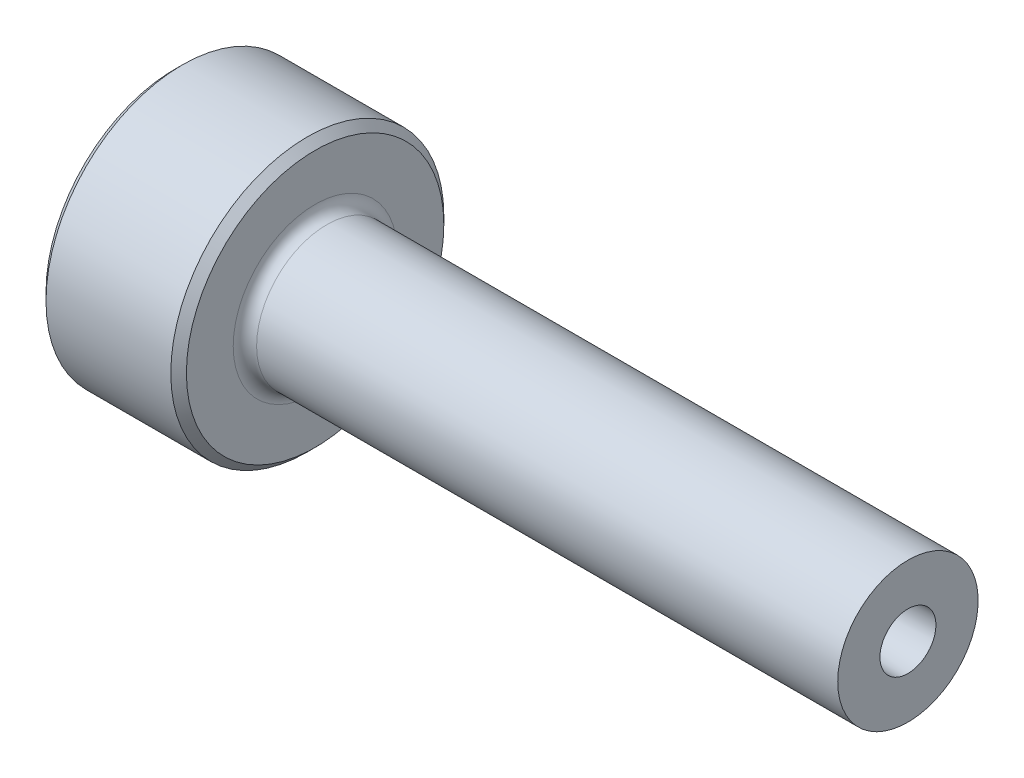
ISO-10303-21;
HEADER;
FILE_DESCRIPTION(('STEP AP214'),'2;1');
FILE_NAME('part.step','',(''),(''),'','','');
FILE_SCHEMA(('AUTOMOTIVE_DESIGN { 1 0 10303 214 1 1 1 1 }'));
ENDSEC;
DATA;
#1=APPLICATION_CONTEXT('core data for automotive mechanical design processes');
#2=APPLICATION_PROTOCOL_DEFINITION('international standard','automotive_design',2000,#1);
#3=PRODUCT_CONTEXT('',#1,'mechanical');
#4=PRODUCT('Part','Part','',(#3));
#5=PRODUCT_RELATED_PRODUCT_CATEGORY('part','',(#4));
#6=PRODUCT_DEFINITION_FORMATION('','',#4);
#7=PRODUCT_DEFINITION_CONTEXT('part definition',#1,'design');
#8=PRODUCT_DEFINITION('design','',#6,#7);
#9=PRODUCT_DEFINITION_SHAPE('','',#8);
#10=(LENGTH_UNIT() NAMED_UNIT(*) SI_UNIT(.MILLI.,.METRE.));
#11=(NAMED_UNIT(*) PLANE_ANGLE_UNIT() SI_UNIT($,.RADIAN.));
#12=(NAMED_UNIT(*) SI_UNIT($,.STERADIAN.) SOLID_ANGLE_UNIT());
#13=UNCERTAINTY_MEASURE_WITH_UNIT(LENGTH_MEASURE(1.E-05),#10,'distance_accuracy_value','');
#14=(GEOMETRIC_REPRESENTATION_CONTEXT(3) GLOBAL_UNCERTAINTY_ASSIGNED_CONTEXT((#13)) GLOBAL_UNIT_ASSIGNED_CONTEXT((#10,
#11,#12)) REPRESENTATION_CONTEXT('',''));
#15=CARTESIAN_POINT('',(0.,0.,0.));
#16=DIRECTION('',(0.,0.,1.));
#17=DIRECTION('',(1.,0.,0.));
#18=AXIS2_PLACEMENT_3D('',#15,#16,#17);
#19=CARTESIAN_POINT('',(0.,4.10062261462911,0.));
#20=DIRECTION('',(1.,0.,0.));
#21=DIRECTION('',(0.,0.,-1.));
#22=AXIS2_PLACEMENT_3D('',#19,#20,#21);
#23=PLANE('',#22);
#24=CARTESIAN_POINT('',(0.,0.,0.));
#25=DIRECTION('',(1.,0.,0.));
#26=DIRECTION('',(0.,0.,-1.));
#27=AXIS2_PLACEMENT_3D('',#24,#25,#26);
#28=CIRCLE('',#27,16.5);
#29=CARTESIAN_POINT('',(0.,0.,-16.5));
#30=VERTEX_POINT('',#29);
#31=EDGE_CURVE('E9',#30,#30,#28,.F.);
#32=ORIENTED_EDGE('',*,*,#31,.T.);
#33=EDGE_LOOP('',(#32));
#34=FACE_BOUND('',#33,.T.);
#35=CARTESIAN_POINT('',(0.,0.,0.));
#36=DIRECTION('',(-1.,0.,0.));
#37=DIRECTION('',(0.,0.,1.));
#38=AXIS2_PLACEMENT_3D('',#35,#36,#37);
#39=CIRCLE('',#38,4.10062261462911);
#40=CARTESIAN_POINT('',(0.,0.,4.10062261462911));
#41=VERTEX_POINT('',#40);
#42=EDGE_CURVE('E49',#41,#41,#39,.T.);
#43=ORIENTED_EDGE('',*,*,#42,.F.);
#44=EDGE_LOOP('',(#43));
#45=FACE_BOUND('',#44,.T.);
#46=ADVANCED_FACE('F14',(#34,#45),#23,.F.);
#47=CARTESIAN_POINT('',(0.,0.,0.));
#48=DIRECTION('',(-1.,0.,0.));
#49=DIRECTION('',(0.,0.,1.));
#50=AXIS2_PLACEMENT_3D('',#47,#48,#49);
#51=CYLINDRICAL_SURFACE('',#50,17.5);
#52=CARTESIAN_POINT('',(17.,0.,0.));
#53=DIRECTION('',(-1.,0.,0.));
#54=DIRECTION('',(0.,0.,1.));
#55=AXIS2_PLACEMENT_3D('',#52,#53,#54);
#56=CIRCLE('',#55,17.5);
#57=CARTESIAN_POINT('',(17.,0.,17.5));
#58=VERTEX_POINT('',#57);
#59=EDGE_CURVE('E25',#58,#58,#56,.T.);
#60=ORIENTED_EDGE('',*,*,#59,.T.);
#61=EDGE_LOOP('',(#60));
#62=FACE_BOUND('',#61,.T.);
#63=CARTESIAN_POINT('',(1.00000000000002,0.,0.));
#64=DIRECTION('',(1.,0.,0.));
#65=DIRECTION('',(0.,0.,-1.));
#66=AXIS2_PLACEMENT_3D('',#63,#64,#65);
#67=CIRCLE('',#66,17.5);
#68=CARTESIAN_POINT('',(1.00000000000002,0.,-17.5));
#69=VERTEX_POINT('',#68);
#70=EDGE_CURVE('E29',#69,#69,#67,.T.);
#71=ORIENTED_EDGE('',*,*,#70,.T.);
#72=EDGE_LOOP('',(#71));
#73=FACE_BOUND('',#72,.T.);
#74=ADVANCED_FACE('F56',(#62,#73),#51,.T.);
#75=CARTESIAN_POINT('',(18.,17.5,0.));
#76=DIRECTION('',(-1.,0.,0.));
#77=DIRECTION('',(0.,0.,1.));
#78=AXIS2_PLACEMENT_3D('',#75,#76,#77);
#79=PLANE('',#78);
#80=CARTESIAN_POINT('',(18.,0.,0.));
#81=DIRECTION('',(-1.,0.,0.));
#82=DIRECTION('',(0.,0.,1.));
#83=AXIS2_PLACEMENT_3D('',#80,#81,#82);
#84=CIRCLE('',#83,16.5);
#85=CARTESIAN_POINT('',(18.,0.,16.5));
#86=VERTEX_POINT('',#85);
#87=EDGE_CURVE('E21',#86,#86,#84,.F.);
#88=ORIENTED_EDGE('',*,*,#87,.T.);
#89=EDGE_LOOP('',(#88));
#90=FACE_BOUND('',#89,.T.);
#91=CARTESIAN_POINT('',(18.,0.,0.));
#92=DIRECTION('',(-1.,0.,0.));
#93=DIRECTION('',(0.,0.,1.));
#94=AXIS2_PLACEMENT_3D('',#91,#92,#93);
#95=CIRCLE('',#94,10.5);
#96=CARTESIAN_POINT('',(18.,0.,10.5));
#97=VERTEX_POINT('',#96);
#98=EDGE_CURVE('E34',#97,#97,#95,.T.);
#99=ORIENTED_EDGE('',*,*,#98,.T.);
#100=EDGE_LOOP('',(#99));
#101=FACE_BOUND('',#100,.T.);
#102=ADVANCED_FACE('F63',(#90,#101),#79,.F.);
#103=CARTESIAN_POINT('',(19.5,0.,0.));
#104=DIRECTION('',(-1.,0.,0.));
#105=DIRECTION('',(0.,0.,1.));
#106=AXIS2_PLACEMENT_3D('',#103,#104,#105);
#107=TOROIDAL_SURFACE('',#106,10.5,1.5);
#108=ORIENTED_EDGE('',*,*,#98,.F.);
#109=EDGE_LOOP('',(#108));
#110=FACE_BOUND('',#109,.T.);
#111=CARTESIAN_POINT('',(19.5,0.,0.));
#112=DIRECTION('',(-1.,0.,0.));
#113=DIRECTION('',(0.,0.,1.));
#114=AXIS2_PLACEMENT_3D('',#111,#112,#113);
#115=CIRCLE('',#114,9.);
#116=CARTESIAN_POINT('',(19.5,0.,9.));
#117=VERTEX_POINT('',#116);
#118=EDGE_CURVE('E37',#117,#117,#115,.T.);
#119=ORIENTED_EDGE('',*,*,#118,.T.);
#120=EDGE_LOOP('',(#119));
#121=FACE_BOUND('',#120,.T.);
#122=ADVANCED_FACE('F99',(#110,#121),#107,.F.);
#123=CARTESIAN_POINT('',(0.,0.,0.));
#124=DIRECTION('',(-1.,0.,0.));
#125=DIRECTION('',(0.,0.,1.));
#126=AXIS2_PLACEMENT_3D('',#123,#124,#125);
#127=CYLINDRICAL_SURFACE('',#126,9.);
#128=ORIENTED_EDGE('',*,*,#118,.F.);
#129=EDGE_LOOP('',(#128));
#130=FACE_BOUND('',#129,.T.);
#131=CARTESIAN_POINT('',(94.,0.,0.));
#132=DIRECTION('',(-1.,0.,0.));
#133=DIRECTION('',(0.,0.,1.));
#134=AXIS2_PLACEMENT_3D('',#131,#132,#133);
#135=CIRCLE('',#134,9.);
#136=CARTESIAN_POINT('',(94.,0.,9.));
#137=VERTEX_POINT('',#136);
#138=EDGE_CURVE('E40',#137,#137,#135,.T.);
#139=ORIENTED_EDGE('',*,*,#138,.T.);
#140=EDGE_LOOP('',(#139));
#141=FACE_BOUND('',#140,.T.);
#142=ADVANCED_FACE('F95',(#130,#141),#127,.T.);
#143=CARTESIAN_POINT('',(94.,3.58841090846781,0.));
#144=DIRECTION('',(-1.,0.,0.));
#145=DIRECTION('',(0.,0.,1.));
#146=AXIS2_PLACEMENT_3D('',#143,#144,#145);
#147=PLANE('',#146);
#148=ORIENTED_EDGE('',*,*,#138,.F.);
#149=EDGE_LOOP('',(#148));
#150=FACE_BOUND('',#149,.T.);
#151=CARTESIAN_POINT('',(94.,0.,0.));
#152=DIRECTION('',(-1.,0.,0.));
#153=DIRECTION('',(0.,0.,1.));
#154=AXIS2_PLACEMENT_3D('',#151,#152,#153);
#155=CIRCLE('',#154,3.58841090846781);
#156=CARTESIAN_POINT('',(94.,0.,3.58841090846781));
#157=VERTEX_POINT('',#156);
#158=EDGE_CURVE('E43',#157,#157,#155,.T.);
#159=ORIENTED_EDGE('',*,*,#158,.T.);
#160=EDGE_LOOP('',(#159));
#161=FACE_BOUND('',#160,.T.);
#162=ADVANCED_FACE('F88',(#150,#161),#147,.F.);
#163=CARTESIAN_POINT('',(3.,0.,0.));
#164=DIRECTION('',(1.,0.,0.));
#165=DIRECTION('',(0.,0.,-1.));
#166=AXIS2_PLACEMENT_3D('',#163,#164,#165);
#167=CONICAL_SURFACE('',#166,2.,0.0174532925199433);
#168=ORIENTED_EDGE('',*,*,#158,.F.);
#169=EDGE_LOOP('',(#168));
#170=FACE_BOUND('',#169,.T.);
#171=CARTESIAN_POINT('',(3.,0.,0.));
#172=DIRECTION('',(-1.,0.,0.));
#173=DIRECTION('',(0.,0.,1.));
#174=AXIS2_PLACEMENT_3D('',#171,#172,#173);
#175=CIRCLE('',#174,2.);
#176=CARTESIAN_POINT('',(3.,0.,2.));
#177=VERTEX_POINT('',#176);
#178=EDGE_CURVE('E46',#177,#177,#175,.T.);
#179=ORIENTED_EDGE('',*,*,#178,.T.);
#180=EDGE_LOOP('',(#179));
#181=FACE_BOUND('',#180,.T.);
#182=ADVANCED_FACE('F76',(#170,#181),#167,.F.);
#183=CARTESIAN_POINT('',(0.,0.,0.));
#184=DIRECTION('',(-1.,0.,0.));
#185=DIRECTION('',(0.,0.,1.));
#186=AXIS2_PLACEMENT_3D('',#183,#184,#185);
#187=CONICAL_SURFACE('',#186,4.10062261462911,0.61086523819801);
#188=ORIENTED_EDGE('',*,*,#178,.F.);
#189=EDGE_LOOP('',(#188));
#190=FACE_BOUND('',#189,.T.);
#191=ORIENTED_EDGE('',*,*,#42,.T.);
#192=EDGE_LOOP('',(#191));
#193=FACE_BOUND('',#192,.T.);
#194=ADVANCED_FACE('F53',(#190,#193),#187,.F.);
#195=CARTESIAN_POINT('',(17.,0.,0.));
#196=DIRECTION('',(-1.,0.,0.));
#197=DIRECTION('',(0.,0.,1.));
#198=AXIS2_PLACEMENT_3D('',#195,#196,#197);
#199=CONICAL_SURFACE('',#198,17.5,0.785398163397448);
#200=ORIENTED_EDGE('',*,*,#87,.F.);
#201=EDGE_LOOP('',(#200));
#202=FACE_BOUND('',#201,.T.);
#203=ORIENTED_EDGE('',*,*,#59,.F.);
#204=EDGE_LOOP('',(#203));
#205=FACE_BOUND('',#204,.T.);
#206=ADVANCED_FACE('F67',(#202,#205),#199,.T.);
#207=CARTESIAN_POINT('',(0.,0.,0.));
#208=DIRECTION('',(1.,0.,0.));
#209=DIRECTION('',(0.,0.,-1.));
#210=AXIS2_PLACEMENT_3D('',#207,#208,#209);
#211=CONICAL_SURFACE('',#210,16.5,0.785398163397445);
#212=ORIENTED_EDGE('',*,*,#70,.F.);
#213=EDGE_LOOP('',(#212));
#214=FACE_BOUND('',#213,.T.);
#215=ORIENTED_EDGE('',*,*,#31,.F.);
#216=EDGE_LOOP('',(#215));
#217=FACE_BOUND('',#216,.T.);
#218=ADVANCED_FACE('F16',(#214,#217),#211,.T.);
#219=CLOSED_SHELL('',(#46,#74,#102,#122,#142,#162,#182,#194,#206,#218));
#220=MANIFOLD_SOLID_BREP('B1',#219);
#221=ADVANCED_BREP_SHAPE_REPRESENTATION('',(#18,#220),#14);
#222=SHAPE_DEFINITION_REPRESENTATION(#9,#221);
ENDSEC;
END-ISO-10303-21;
